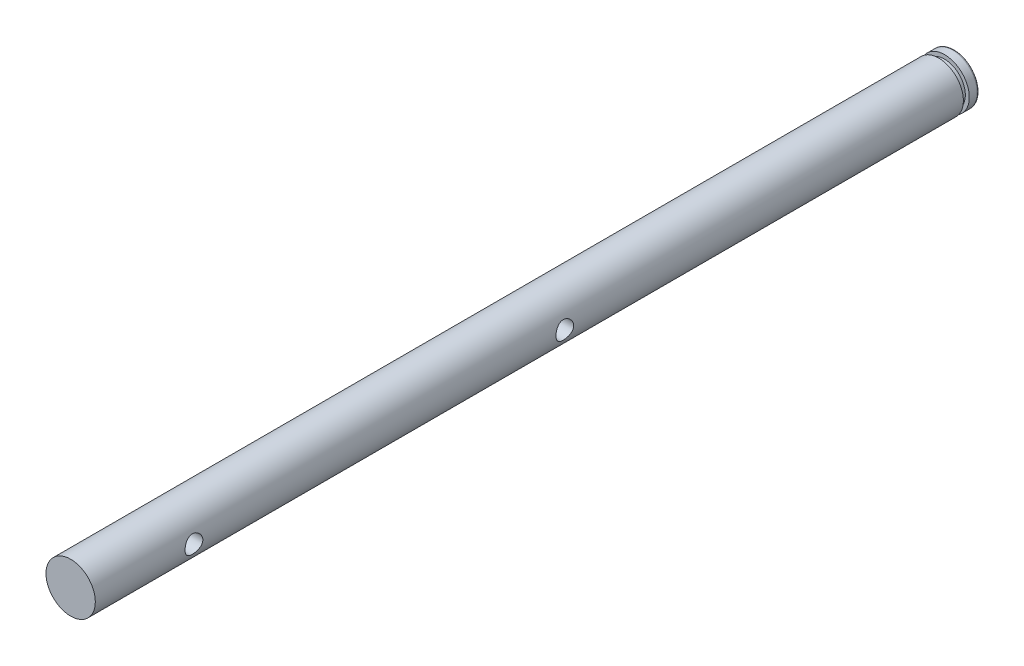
from build123d import *

# Parameters (mm, degrees)
SKETCH1_R               = 3.175
BOSS_EXTRUDE1_DEPTH     = 113.792
CUT_EXTRUDE1_DEPTH      = 114.880553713
CUT_EXTRUDE1_DEPTH_BACK = 114.880553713
SKETCH2_R               = 1.143
SKETCH3_W               = 0.762
SKETCH3_H               = 0.508
FILLET1_R               = 0.254


with BuildPart() as part:
    # Sketch1 → Boss-Extrude1 (new body)
    with BuildSketch(Plane.XY):
        Circle(SKETCH1_R)
    extrude(amount=BOSS_EXTRUDE1_DEPTH)

    # Sketch2 → Cut-Extrude1 (cut, two sides: drawn at the far end of the back side and taken through both)
    with BuildSketch(Plane(origin=(0, 0, 0), x_dir=(0, 0, -1), z_dir=(1, 0, 0)).offset(-CUT_EXTRUDE1_DEPTH_BACK)):
        with Locations(Location((-101.092, 0, 0), (0, 0, 180))):
            Circle(SKETCH2_R)
        with Locations(Location((-53.34, 0, 0), (0, 0, 180))):
            Circle(SKETCH2_R)
    extrude(amount=CUT_EXTRUDE1_DEPTH + CUT_EXTRUDE1_DEPTH_BACK, mode=Mode.SUBTRACT)

    # Sketch3 → Cut-Revolve1 (revolve, cut)
    with BuildSketch(Plane(origin=(0, 0, 0), x_dir=(0, 0, -1), z_dir=(1, 0, 0)), mode=Mode.PRIVATE) as cut_revolve1_sk:
        with Locations((-1.651, 2.921)):
            Rectangle(SKETCH3_W, SKETCH3_H)
    revolve(cut_revolve1_sk.sketch.rotate(Axis((0, 0, 0), (0, 0, 1)), 90), axis=Axis((0, 0, 0), (0, 0, 1)), mode=Mode.SUBTRACT)

    # Fillet1
    fillet1_edges = [part.edges().sort_by_distance(p)[0] for p in [
        (-3.175, 0, 0),
    ]]
    fillet(fillet1_edges, radius=FILLET1_R)


solid = part.part
